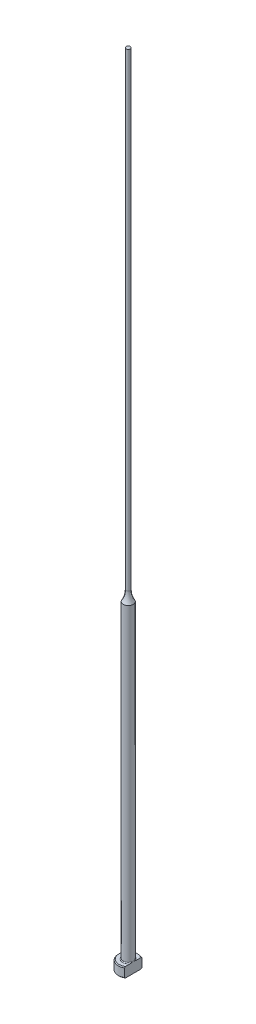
ISO-10303-21;
HEADER;
FILE_DESCRIPTION(('STEP AP214'),'2;1');
FILE_NAME('part.step','',(''),(''),'','','');
FILE_SCHEMA(('AUTOMOTIVE_DESIGN { 1 0 10303 214 1 1 1 1 }'));
ENDSEC;
DATA;
#1=APPLICATION_CONTEXT('core data for automotive mechanical design processes');
#2=APPLICATION_PROTOCOL_DEFINITION('international standard','automotive_design',2000,#1);
#3=PRODUCT_CONTEXT('',#1,'mechanical');
#4=PRODUCT('Part','Part','',(#3));
#5=PRODUCT_RELATED_PRODUCT_CATEGORY('part','',(#4));
#6=PRODUCT_DEFINITION_FORMATION('','',#4);
#7=PRODUCT_DEFINITION_CONTEXT('part definition',#1,'design');
#8=PRODUCT_DEFINITION('design','',#6,#7);
#9=PRODUCT_DEFINITION_SHAPE('','',#8);
#10=(LENGTH_UNIT() NAMED_UNIT(*) SI_UNIT(.MILLI.,.METRE.));
#11=(NAMED_UNIT(*) PLANE_ANGLE_UNIT() SI_UNIT($,.RADIAN.));
#12=(NAMED_UNIT(*) SI_UNIT($,.STERADIAN.) SOLID_ANGLE_UNIT());
#13=UNCERTAINTY_MEASURE_WITH_UNIT(LENGTH_MEASURE(1.E-05),#10,'distance_accuracy_value','');
#14=(GEOMETRIC_REPRESENTATION_CONTEXT(3) GLOBAL_UNCERTAINTY_ASSIGNED_CONTEXT((#13)) GLOBAL_UNIT_ASSIGNED_CONTEXT((#10,
#11,#12)) REPRESENTATION_CONTEXT('',''));
#15=CARTESIAN_POINT('',(0.,0.,0.));
#16=DIRECTION('',(0.,0.,1.));
#17=DIRECTION('',(1.,0.,0.));
#18=AXIS2_PLACEMENT_3D('',#15,#16,#17);
#19=CARTESIAN_POINT('',(-3.17499999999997,3.175,0.));
#20=DIRECTION('',(0.,1.,0.));
#21=DIRECTION('',(0.,0.,1.));
#22=AXIS2_PLACEMENT_3D('',#19,#20,#21);
#23=PLANE('',#22);
#24=CARTESIAN_POINT('',(0.,3.175,0.));
#25=DIRECTION('',(0.,1.,0.));
#26=DIRECTION('',(0.,0.,1.));
#27=AXIS2_PLACEMENT_3D('',#24,#25,#26);
#28=CIRCLE('',#27,2.92099999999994);
#29=CARTESIAN_POINT('',(1.58749999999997,3.175,-2.45195529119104));
#30=VERTEX_POINT('',#29);
#31=CARTESIAN_POINT('',(1.58749999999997,3.175,2.45195529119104));
#32=VERTEX_POINT('',#31);
#33=EDGE_CURVE('E105',#30,#32,#28,.T.);
#34=ORIENTED_EDGE('',*,*,#33,.T.);
#35=DIRECTION('',(0.,0.,1.));
#36=VECTOR('',#35,1.);
#37=CARTESIAN_POINT('',(1.58749999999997,3.17499999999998,2.74963065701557));
#38=LINE('',#37,#36);
#39=CARTESIAN_POINT('',(1.58749999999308,3.175,0.933255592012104));
#40=VERTEX_POINT('',#39);
#41=EDGE_CURVE('E126',#40,#32,#38,.T.);
#42=ORIENTED_EDGE('',*,*,#41,.F.);
#43=CARTESIAN_POINT('',(0.,3.175,0.));
#44=DIRECTION('',(0.,1.,0.));
#45=DIRECTION('',(0.,0.,1.));
#46=AXIS2_PLACEMENT_3D('',#43,#44,#45);
#47=CIRCLE('',#46,1.84149999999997);
#48=CARTESIAN_POINT('',(1.58749999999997,3.17500000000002,-0.933255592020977));
#49=VERTEX_POINT('',#48);
#50=EDGE_CURVE('E11',#40,#49,#47,.F.);
#51=ORIENTED_EDGE('',*,*,#50,.T.);
#52=EDGE_CURVE('E52',#30,#49,#38,.T.);
#53=ORIENTED_EDGE('',*,*,#52,.F.);
#54=EDGE_LOOP('',(#34,#42,#51,#53));
#55=FACE_BOUND('',#54,.T.);
#56=ADVANCED_FACE('F32',(#55),#23,.T.);
#57=CARTESIAN_POINT('',(0.,259.958771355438,0.));
#58=DIRECTION('',(0.,1.,0.));
#59=DIRECTION('',(0.,0.,1.));
#60=AXIS2_PLACEMENT_3D('',#57,#58,#59);
#61=CYLINDRICAL_SURFACE('',#60,3.17499999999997);
#62=CARTESIAN_POINT('',(0.,2.92100000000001,0.));
#63=DIRECTION('',(0.,1.,0.));
#64=DIRECTION('',(0.,0.,1.));
#65=AXIS2_PLACEMENT_3D('',#62,#63,#64);
#66=CIRCLE('',#65,3.17499999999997);
#67=CARTESIAN_POINT('',(1.58749999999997,2.92100000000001,2.74963065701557));
#68=VERTEX_POINT('',#67);
#69=CARTESIAN_POINT('',(1.58749999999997,2.92100000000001,-2.74963065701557));
#70=VERTEX_POINT('',#69);
#71=EDGE_CURVE('E98',#68,#70,#66,.F.);
#72=ORIENTED_EDGE('',*,*,#71,.T.);
#73=DIRECTION('',(0.,-1.,0.));
#74=VECTOR('',#73,1.);
#75=CARTESIAN_POINT('',(1.58749999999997,254.001,-2.74963065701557));
#76=LINE('',#75,#74);
#77=CARTESIAN_POINT('',(1.58749999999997,0.253999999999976,-2.74963065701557));
#78=VERTEX_POINT('',#77);
#79=EDGE_CURVE('E141',#70,#78,#76,.T.);
#80=ORIENTED_EDGE('',*,*,#79,.T.);
#81=CARTESIAN_POINT('',(0.,0.253999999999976,0.));
#82=DIRECTION('',(0.,-1.,0.));
#83=DIRECTION('',(0.,0.,-1.));
#84=AXIS2_PLACEMENT_3D('',#81,#82,#83);
#85=CIRCLE('',#84,3.17499999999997);
#86=CARTESIAN_POINT('',(1.58749999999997,0.253999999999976,2.74963065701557));
#87=VERTEX_POINT('',#86);
#88=EDGE_CURVE('E95',#78,#87,#85,.F.);
#89=ORIENTED_EDGE('',*,*,#88,.T.);
#90=DIRECTION('',(0.,-1.,0.));
#91=VECTOR('',#90,1.);
#92=CARTESIAN_POINT('',(1.58749999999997,254.001,2.74963065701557));
#93=LINE('',#92,#91);
#94=EDGE_CURVE('E88',#68,#87,#93,.T.);
#95=ORIENTED_EDGE('',*,*,#94,.F.);
#96=EDGE_LOOP('',(#72,#80,#89,#95));
#97=FACE_BOUND('',#96,.T.);
#98=ADVANCED_FACE('F191',(#97),#61,.T.);
#99=CARTESIAN_POINT('',(0.,0.,0.));
#100=DIRECTION('',(0.,-1.,0.));
#101=DIRECTION('',(0.,0.,-1.));
#102=AXIS2_PLACEMENT_3D('',#99,#100,#101);
#103=PLANE('',#102);
#104=CARTESIAN_POINT('',(0.,0.,0.));
#105=DIRECTION('',(0.,-1.,0.));
#106=DIRECTION('',(0.,0.,-1.));
#107=AXIS2_PLACEMENT_3D('',#104,#105,#106);
#108=CIRCLE('',#107,2.92100000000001);
#109=CARTESIAN_POINT('',(1.58749999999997,0.,2.45195529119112));
#110=VERTEX_POINT('',#109);
#111=CARTESIAN_POINT('',(1.58749999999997,0.,-2.45195529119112));
#112=VERTEX_POINT('',#111);
#113=EDGE_CURVE('E93',#110,#112,#108,.T.);
#114=ORIENTED_EDGE('',*,*,#113,.T.);
#115=DIRECTION('',(0.,0.,1.));
#116=VECTOR('',#115,1.);
#117=CARTESIAN_POINT('',(1.58749999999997,0.,2.74963065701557));
#118=LINE('',#117,#116);
#119=EDGE_CURVE('E78',#112,#110,#118,.T.);
#120=ORIENTED_EDGE('',*,*,#119,.T.);
#121=EDGE_LOOP('',(#114,#120));
#122=FACE_BOUND('',#121,.T.);
#123=ADVANCED_FACE('F97',(#122),#103,.T.);
#124=CARTESIAN_POINT('',(0.,3.17499999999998,0.));
#125=DIRECTION('',(0.,-1.,0.));
#126=DIRECTION('',(0.,0.,-1.));
#127=AXIS2_PLACEMENT_3D('',#124,#125,#126);
#128=CONICAL_SURFACE('',#127,2.92099999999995,0.785398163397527);
#129=ORIENTED_EDGE('',*,*,#71,.F.);
#130=CARTESIAN_POINT('',(1.58749999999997,-0.16162066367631,-6.0529050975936));
#131=CARTESIAN_POINT('',(1.58749999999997,-0.0288893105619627,-5.91567682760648));
#132=CARTESIAN_POINT('',(1.58749999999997,0.103699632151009,-5.7783103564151));
#133=CARTESIAN_POINT('',(1.58749999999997,0.368508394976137,-5.50321874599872));
#134=CARTESIAN_POINT('',(1.58749999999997,0.500728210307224,-5.36549360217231));
#135=CARTESIAN_POINT('',(1.58749999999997,0.764778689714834,-5.08953516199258));
#136=CARTESIAN_POINT('',(1.58749999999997,0.896609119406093,-4.9513016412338));
#137=CARTESIAN_POINT('',(1.58749999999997,1.15968706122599,-4.67428233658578));
#138=CARTESIAN_POINT('',(1.58749999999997,1.29093457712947,-4.53549655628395));
#139=CARTESIAN_POINT('',(1.58749999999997,1.55007705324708,-4.25997724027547));
#140=CARTESIAN_POINT('',(1.58749999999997,1.67798684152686,-4.12325766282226));
#141=CARTESIAN_POINT('',(1.58749999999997,1.9328486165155,-3.84892898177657));
#142=CARTESIAN_POINT('',(1.58749999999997,2.05980060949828,-3.71131988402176));
#143=CARTESIAN_POINT('',(1.58749999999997,2.31237508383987,-3.43493978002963));
#144=CARTESIAN_POINT('',(1.58749999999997,2.43799784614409,-3.29616903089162));
#145=CARTESIAN_POINT('',(1.58749999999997,2.68741369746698,-3.01699558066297));
#146=CARTESIAN_POINT('',(1.58749999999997,2.81120686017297,-2.8765929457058));
#147=CARTESIAN_POINT('',(1.58749999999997,3.00875865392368,-2.64816703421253));
#148=CARTESIAN_POINT('',(1.58749999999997,3.08336151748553,-2.56087478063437));
#149=CARTESIAN_POINT('',(1.58749999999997,3.2312387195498,-2.38515423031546));
#150=CARTESIAN_POINT('',(1.58749999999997,3.30451292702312,-2.29672582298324));
#151=CARTESIAN_POINT('',(1.58749999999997,3.45004422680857,-2.1174740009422));
#152=CARTESIAN_POINT('',(1.58749999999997,3.5222823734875,-2.02663514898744));
#153=CARTESIAN_POINT('',(1.58749999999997,3.66423097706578,-1.8430252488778));
#154=CARTESIAN_POINT('',(1.58749999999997,3.73394203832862,-1.75025467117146));
#155=CARTESIAN_POINT('',(1.58749999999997,3.87080633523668,-1.5606747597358));
#156=CARTESIAN_POINT('',(1.58749999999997,3.93790459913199,-1.46382547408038));
#157=CARTESIAN_POINT('',(1.58749999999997,4.06669147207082,-1.26632594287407));
#158=CARTESIAN_POINT('',(1.58749999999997,4.1283726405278,-1.16567073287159));
#159=CARTESIAN_POINT('',(1.58749999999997,4.21402252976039,-1.01165766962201));
#160=CARTESIAN_POINT('',(1.58749999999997,4.24127929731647,-0.960142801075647));
#161=CARTESIAN_POINT('',(1.58749999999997,4.2930979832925,-0.855780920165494));
#162=CARTESIAN_POINT('',(1.58749999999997,4.31765941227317,-0.802933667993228));
#163=CARTESIAN_POINT('',(1.58749999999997,4.38614656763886,-0.642461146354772));
#164=CARTESIAN_POINT('',(1.58749999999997,4.42510149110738,-0.532518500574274));
#165=CARTESIAN_POINT('',(1.58749999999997,4.46726244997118,-0.367680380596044));
#166=CARTESIAN_POINT('',(1.58749999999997,4.47844427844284,-0.314802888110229));
#167=CARTESIAN_POINT('',(1.58749999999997,4.49576654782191,-0.208209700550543));
#168=CARTESIAN_POINT('',(1.58749999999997,4.50190743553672,-0.154494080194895));
#169=CARTESIAN_POINT('',(1.58749999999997,4.50871296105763,-0.0468792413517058));
#170=CARTESIAN_POINT('',(1.58749999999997,4.5093945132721,0.00701889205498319));
#171=CARTESIAN_POINT('',(1.58749999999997,4.50527679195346,0.114606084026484));
#172=CARTESIAN_POINT('',(1.58749999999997,4.50047706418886,0.168295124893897));
#173=CARTESIAN_POINT('',(1.58749999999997,4.48579689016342,0.27448544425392));
#174=CARTESIAN_POINT('',(1.58749999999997,4.47596081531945,0.32699298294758));
#175=CARTESIAN_POINT('',(1.58749999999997,4.45181809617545,0.430974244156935));
#176=CARTESIAN_POINT('',(1.58749999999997,4.4375096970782,0.482447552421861));
#177=CARTESIAN_POINT('',(1.58749999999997,4.40502489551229,0.584460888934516));
#178=CARTESIAN_POINT('',(1.58749999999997,4.386827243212,0.634994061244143));
#179=CARTESIAN_POINT('',(1.58749999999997,4.34729308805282,0.734789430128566));
#180=CARTESIAN_POINT('',(1.58749999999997,4.3259572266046,0.784051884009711));
#181=CARTESIAN_POINT('',(1.58749999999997,4.25791922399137,0.930549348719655));
#182=CARTESIAN_POINT('',(1.58749999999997,4.20736047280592,1.0259880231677));
#183=CARTESIAN_POINT('',(1.58749999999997,4.0995545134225,1.21304313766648));
#184=CARTESIAN_POINT('',(1.58749999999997,4.04229912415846,1.30465471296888));
#185=CARTESIAN_POINT('',(1.58749999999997,3.92308746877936,1.48526211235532));
#186=CARTESIAN_POINT('',(1.58749999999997,3.86111349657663,1.57424615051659));
#187=CARTESIAN_POINT('',(1.58749999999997,3.73408621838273,1.74990003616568));
#188=CARTESIAN_POINT('',(1.58749999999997,3.66903444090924,1.83657099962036));
#189=CARTESIAN_POINT('',(1.58749999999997,3.53583371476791,2.00931764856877));
#190=CARTESIAN_POINT('',(1.58749999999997,3.46765527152,2.09537048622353));
#191=CARTESIAN_POINT('',(1.58749999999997,3.32960643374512,2.26611736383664));
#192=CARTESIAN_POINT('',(1.58749999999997,3.25973586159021,2.35081125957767));
#193=CARTESIAN_POINT('',(1.58749999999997,3.04858139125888,2.60290121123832));
#194=CARTESIAN_POINT('',(1.58749999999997,2.90542388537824,2.76872537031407));
#195=CARTESIAN_POINT('',(1.58749999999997,2.64069522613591,3.06970913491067));
#196=CARTESIAN_POINT('',(1.58749999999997,2.51959458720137,3.20528660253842));
#197=CARTESIAN_POINT('',(1.58749999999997,2.27590400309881,3.47510321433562));
#198=CARTESIAN_POINT('',(1.58749999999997,2.15331401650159,3.60934232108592));
#199=CARTESIAN_POINT('',(1.58749999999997,1.90694239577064,3.87695374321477));
#200=CARTESIAN_POINT('',(1.58749999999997,1.78315974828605,4.0103251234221));
#201=CARTESIAN_POINT('',(1.58749999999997,1.53478104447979,4.27630880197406));
#202=CARTESIAN_POINT('',(1.58749999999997,1.41018498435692,4.40892109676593));
#203=CARTESIAN_POINT('',(1.58749999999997,1.0457468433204,4.79499418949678));
#204=CARTESIAN_POINT('',(1.58749999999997,0.80507680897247,5.04767313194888));
#205=CARTESIAN_POINT('',(1.58749999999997,0.443121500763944,5.42550911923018));
#206=CARTESIAN_POINT('',(1.58749999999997,0.322378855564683,5.55118772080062));
#207=CARTESIAN_POINT('',(1.58749999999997,0.0805914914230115,5.80225207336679));
#208=CARTESIAN_POINT('',(1.58749999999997,-0.040453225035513,5.92763782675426));
#209=CARTESIAN_POINT('',(1.58749999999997,-0.161620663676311,6.0529050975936));
#210=B_SPLINE_CURVE_WITH_KNOTS('',3,(#130,#131,#132,#133,#134,#135,#136,#137,#138,#139,#140,
#141,#142,#143,#144,#145,#146,#147,#148,#149,#150,#151,#152,#153,#154,#155,#156,#157,#158,#159,
#160,#161,#162,#163,#164,#165,#166,#167,#168,#169,#170,#171,#172,#173,#174,#175,#176,#177,#178,
#179,#180,#181,#182,#183,#184,#185,#186,#187,#188,#189,#190,#191,#192,#193,#194,#195,#196,#197,
#198,#199,#200,#201,#202,#203,#204,#205,#206,#207,#208,#209),.UNSPECIFIED.,.F.,.F.,(4,2,2,2,2,2,
2,2,2,2,2,2,2,2,2,2,2,2,2,2,2,2,2,2,2,2,2,2,2,2,2,2,2,2,2,2,2,2,2,4),(0.,0.572750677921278,
1.14550874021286,1.71856057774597,2.29160869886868,2.85328006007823,3.4149477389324,
3.97649423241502,4.53801804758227,4.88249307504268,5.22700189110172,5.5751532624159,
5.92322081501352,6.27657800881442,6.63041319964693,6.80518126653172,6.9799810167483,
7.3282426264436,7.49018491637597,7.65211285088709,7.81353889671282,7.97497832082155,
8.13501929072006,8.29512313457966,8.45612518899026,8.61709438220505,8.94062993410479,
9.2645649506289,9.58978187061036,9.91483894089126,10.2441741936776,10.5735441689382,
11.2306812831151,11.7760337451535,12.3214014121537,12.8672825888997,13.4131663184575,
14.4600164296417,14.9828595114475,15.5056983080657),.UNSPECIFIED.);
#211=EDGE_CURVE('E118',#32,#68,#210,.T.);
#212=ORIENTED_EDGE('',*,*,#211,.F.);
#213=ORIENTED_EDGE('',*,*,#33,.F.);
#214=EDGE_CURVE('E117',#70,#30,#210,.T.);
#215=ORIENTED_EDGE('',*,*,#214,.F.);
#216=EDGE_LOOP('',(#129,#212,#213,#215));
#217=FACE_BOUND('',#216,.T.);
#218=ADVANCED_FACE('F162',(#217),#128,.T.);
#219=CARTESIAN_POINT('',(0.,0.253999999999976,0.));
#220=DIRECTION('',(0.,1.,0.));
#221=DIRECTION('',(0.,0.,1.));
#222=AXIS2_PLACEMENT_3D('',#219,#220,#221);
#223=CONICAL_SURFACE('',#222,3.17499999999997,0.785398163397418);
#224=ORIENTED_EDGE('',*,*,#88,.F.);
#225=CARTESIAN_POINT('',(1.58749999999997,3.33662066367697,6.0529050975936));
#226=CARTESIAN_POINT('',(1.58749999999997,3.20388931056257,5.91567682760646));
#227=CARTESIAN_POINT('',(1.58749999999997,3.07130036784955,5.77831035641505));
#228=CARTESIAN_POINT('',(1.58749999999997,2.80649160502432,5.50321874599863));
#229=CARTESIAN_POINT('',(1.58749999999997,2.67427178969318,5.3654936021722));
#230=CARTESIAN_POINT('',(1.58749999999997,2.41022131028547,5.08953516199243));
#231=CARTESIAN_POINT('',(1.58749999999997,2.27839088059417,4.95130164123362));
#232=CARTESIAN_POINT('',(1.58749999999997,2.01531293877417,4.67428233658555));
#233=CARTESIAN_POINT('',(1.58749999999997,1.88406542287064,4.5354965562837));
#234=CARTESIAN_POINT('',(1.58749999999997,1.62492294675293,4.25997724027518));
#235=CARTESIAN_POINT('',(1.58749999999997,1.49701315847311,4.12325766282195));
#236=CARTESIAN_POINT('',(1.58749999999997,1.24215138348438,3.84892898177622));
#237=CARTESIAN_POINT('',(1.58749999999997,1.11519939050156,3.71131988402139));
#238=CARTESIAN_POINT('',(1.58749999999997,0.862624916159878,3.43493978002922));
#239=CARTESIAN_POINT('',(1.58749999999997,0.737002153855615,3.29616903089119));
#240=CARTESIAN_POINT('',(1.58749999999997,0.487586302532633,3.01699558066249));
#241=CARTESIAN_POINT('',(1.58749999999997,0.363793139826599,2.8765929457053));
#242=CARTESIAN_POINT('',(1.58749999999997,0.166241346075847,2.64816703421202));
#243=CARTESIAN_POINT('',(1.58749999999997,0.0916384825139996,2.56087478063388));
#244=CARTESIAN_POINT('',(1.58749999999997,-0.0562387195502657,2.385154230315));
#245=CARTESIAN_POINT('',(1.58749999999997,-0.129512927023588,2.29672582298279));
#246=CARTESIAN_POINT('',(1.58749999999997,-0.27504422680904,2.11747400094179));
#247=CARTESIAN_POINT('',(1.58749999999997,-0.347282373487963,2.02663514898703));
#248=CARTESIAN_POINT('',(1.58749999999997,-0.489230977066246,1.84302524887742));
#249=CARTESIAN_POINT('',(1.58749999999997,-0.558942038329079,1.7502546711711));
#250=CARTESIAN_POINT('',(1.58749999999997,-0.695806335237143,1.56067475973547));
#251=CARTESIAN_POINT('',(1.58749999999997,-0.762904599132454,1.46382547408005));
#252=CARTESIAN_POINT('',(1.58749999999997,-0.891691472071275,1.26632594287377));
#253=CARTESIAN_POINT('',(1.58749999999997,-0.953372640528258,1.16567073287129));
#254=CARTESIAN_POINT('',(1.58749999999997,-1.03902252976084,1.01165766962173));
#255=CARTESIAN_POINT('',(1.58749999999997,-1.06627929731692,0.960142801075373));
#256=CARTESIAN_POINT('',(1.58749999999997,-1.11809798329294,0.85578092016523));
#257=CARTESIAN_POINT('',(1.58749999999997,-1.14265941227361,0.802933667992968));
#258=CARTESIAN_POINT('',(1.58749999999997,-1.21114656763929,0.642461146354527));
#259=CARTESIAN_POINT('',(1.58749999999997,-1.2501014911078,0.532518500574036));
#260=CARTESIAN_POINT('',(1.58749999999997,-1.29226244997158,0.367680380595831));
#261=CARTESIAN_POINT('',(1.58749999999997,-1.30344427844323,0.314802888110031));
#262=CARTESIAN_POINT('',(1.58749999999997,-1.32076654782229,0.208209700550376));
#263=CARTESIAN_POINT('',(1.58749999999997,-1.3269074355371,0.154494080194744));
#264=CARTESIAN_POINT('',(1.58749999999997,-1.333712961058,0.0468792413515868));
#265=CARTESIAN_POINT('',(1.58749999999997,-1.33439451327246,-0.00701889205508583));
#266=CARTESIAN_POINT('',(1.58749999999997,-1.33027679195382,-0.114606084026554));
#267=CARTESIAN_POINT('',(1.58749999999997,-1.32547706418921,-0.168295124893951));
#268=CARTESIAN_POINT('',(1.58749999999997,-1.31079689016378,-0.274485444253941));
#269=CARTESIAN_POINT('',(1.58749999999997,-1.3009608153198,-0.326992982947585));
#270=CARTESIAN_POINT('',(1.58749999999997,-1.27681809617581,-0.430974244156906));
#271=CARTESIAN_POINT('',(1.58749999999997,-1.26250969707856,-0.482447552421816));
#272=CARTESIAN_POINT('',(1.58749999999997,-1.23002489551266,-0.584460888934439));
#273=CARTESIAN_POINT('',(1.58749999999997,-1.21182724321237,-0.634994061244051));
#274=CARTESIAN_POINT('',(1.58749999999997,-1.1722930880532,-0.734789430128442));
#275=CARTESIAN_POINT('',(1.58749999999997,-1.15095722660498,-0.784051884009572));
#276=CARTESIAN_POINT('',(1.58749999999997,-1.08291922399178,-0.93054934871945));
#277=CARTESIAN_POINT('',(1.58749999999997,-1.03236047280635,-1.02598802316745));
#278=CARTESIAN_POINT('',(1.58749999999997,-0.924554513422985,-1.21304313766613));
#279=CARTESIAN_POINT('',(1.58749999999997,-0.86729912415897,-1.30465471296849));
#280=CARTESIAN_POINT('',(1.58749999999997,-0.748087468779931,-1.48526211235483));
#281=CARTESIAN_POINT('',(1.58749999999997,-0.686113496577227,-1.57424615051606));
#282=CARTESIAN_POINT('',(1.58749999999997,-0.55908621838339,-1.74990003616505));
#283=CARTESIAN_POINT('',(1.58749999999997,-0.494034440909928,-1.83657099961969));
#284=CARTESIAN_POINT('',(1.58749999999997,-0.360833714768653,-2.00931764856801));
#285=CARTESIAN_POINT('',(1.58749999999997,-0.292655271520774,-2.09537048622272));
#286=CARTESIAN_POINT('',(1.58749999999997,-0.154606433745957,-2.26611736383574));
#287=CARTESIAN_POINT('',(1.58749999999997,-0.0847358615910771,-2.35081125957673));
#288=CARTESIAN_POINT('',(1.58749999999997,0.126418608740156,-2.60290121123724));
#289=CARTESIAN_POINT('',(1.58749999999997,0.269576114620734,-2.76872537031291));
#290=CARTESIAN_POINT('',(1.58749999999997,0.534304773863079,-3.06970913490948));
#291=CARTESIAN_POINT('',(1.58749999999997,0.655405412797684,-3.20528660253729));
#292=CARTESIAN_POINT('',(1.58749999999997,0.899095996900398,-3.47510321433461));
#293=CARTESIAN_POINT('',(1.58749999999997,1.02168598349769,-3.60934232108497));
#294=CARTESIAN_POINT('',(1.58749999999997,1.26805760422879,-3.87695374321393));
#295=CARTESIAN_POINT('',(1.58749999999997,1.39184025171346,-4.01032512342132));
#296=CARTESIAN_POINT('',(1.58749999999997,1.64021895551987,-4.2763088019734));
#297=CARTESIAN_POINT('',(1.58749999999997,1.76481501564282,-4.40892109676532));
#298=CARTESIAN_POINT('',(1.58749999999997,2.12925315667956,-4.79499418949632));
#299=CARTESIAN_POINT('',(1.58749999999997,2.36992319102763,-5.04767313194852));
#300=CARTESIAN_POINT('',(1.58749999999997,2.73187849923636,-5.42550911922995));
#301=CARTESIAN_POINT('',(1.58749999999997,2.85262114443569,-5.55118772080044));
#302=CARTESIAN_POINT('',(1.58749999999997,3.09440850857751,-5.8022520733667));
#303=CARTESIAN_POINT('',(1.58749999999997,3.2154532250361,-5.92763782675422));
#304=CARTESIAN_POINT('',(1.58749999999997,3.33662066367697,-6.0529050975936));
#305=B_SPLINE_CURVE_WITH_KNOTS('',3,(#225,#226,#227,#228,#229,#230,#231,#232,#233,#234,#235,
#236,#237,#238,#239,#240,#241,#242,#243,#244,#245,#246,#247,#248,#249,#250,#251,#252,#253,#254,
#255,#256,#257,#258,#259,#260,#261,#262,#263,#264,#265,#266,#267,#268,#269,#270,#271,#272,#273,
#274,#275,#276,#277,#278,#279,#280,#281,#282,#283,#284,#285,#286,#287,#288,#289,#290,#291,#292,
#293,#294,#295,#296,#297,#298,#299,#300,#301,#302,#303,#304),.UNSPECIFIED.,.F.,.F.,(4,2,2,2,2,2,
2,2,2,2,2,2,2,2,2,2,2,2,2,2,2,2,2,2,2,2,2,2,2,2,2,2,2,2,2,2,2,2,2,4),(0.,0.57275067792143,
1.14550874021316,1.71856057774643,2.29160869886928,2.85328006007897,3.41494773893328,
3.97649423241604,4.53801804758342,4.88249307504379,5.2270018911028,5.57515326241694,
5.92322081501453,6.27657800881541,6.63041319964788,6.80518126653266,6.97998101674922,
7.32824262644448,7.49018491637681,7.65211285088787,7.81353889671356,7.97497832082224,
8.1350192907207,8.29512313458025,8.45612518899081,8.61709438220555,8.94062993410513,
9.26456495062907,9.58978187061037,9.91483894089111,10.2441741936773,10.5735441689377,
11.2306812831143,11.776033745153,12.3214014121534,12.8672825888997,13.4131663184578,
14.4600164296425,14.9828595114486,15.505698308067),.UNSPECIFIED.);
#306=EDGE_CURVE('E81',#112,#78,#305,.T.);
#307=ORIENTED_EDGE('',*,*,#306,.F.);
#308=ORIENTED_EDGE('',*,*,#113,.F.);
#309=EDGE_CURVE('E84',#87,#110,#305,.T.);
#310=ORIENTED_EDGE('',*,*,#309,.F.);
#311=EDGE_LOOP('',(#224,#307,#308,#310));
#312=FACE_BOUND('',#311,.T.);
#313=ADVANCED_FACE('F92',(#312),#223,.T.);
#314=CARTESIAN_POINT('',(0.,3.42900000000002,0.));
#315=DIRECTION('',(0.,1.,0.));
#316=DIRECTION('',(0.,0.,1.));
#317=AXIS2_PLACEMENT_3D('',#314,#315,#316);
#318=TOROIDAL_SURFACE('',#317,1.84149999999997,0.254);
#319=CARTESIAN_POINT('',(1.58749999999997,3.42900000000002,0.));
#320=CARTESIAN_POINT('',(1.58749999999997,3.42899942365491,-1.9220514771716E-10));
#321=CARTESIAN_POINT('',(1.58749999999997,3.42899884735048,-1.2261161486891E-07));
#322=CARTESIAN_POINT('',(1.58749999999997,3.42899773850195,-5.09676365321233E-07));
#323=CARTESIAN_POINT('',(1.58749999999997,3.42899720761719,-7.78176328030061E-07));
#324=CARTESIAN_POINT('',(1.58749999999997,3.42899614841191,-1.42307272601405E-06));
#325=CARTESIAN_POINT('',(1.58749999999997,3.42899562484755,-1.80713867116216E-06));
#326=CARTESIAN_POINT('',(1.58749999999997,3.42899463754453,-2.63494846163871E-06));
#327=CARTESIAN_POINT('',(1.58749999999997,3.42899417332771,-3.07814756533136E-06));
#328=CARTESIAN_POINT('',(1.58749999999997,3.42899261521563,-4.66897357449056E-06));
#329=CARTESIAN_POINT('',(1.58749999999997,3.42899159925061,-5.89404908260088E-06));
#330=CARTESIAN_POINT('',(1.58749999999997,3.42898979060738,-8.42427511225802E-06));
#331=CARTESIAN_POINT('',(1.58749999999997,3.42898899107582,-9.7248057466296E-06));
#332=CARTESIAN_POINT('',(1.58749999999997,3.42898598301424,-1.48060601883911E-05));
#333=CARTESIAN_POINT('',(1.58749999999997,3.42898393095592,-1.86838281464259E-05));
#334=CARTESIAN_POINT('',(1.58749999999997,3.42898057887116,-2.63261117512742E-05));
#335=CARTESIAN_POINT('',(1.58749999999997,3.42897922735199,-3.00687417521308E-05));
#336=CARTESIAN_POINT('',(1.58749999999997,3.42897347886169,-4.60276298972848E-05));
#337=CARTESIAN_POINT('',(1.58749999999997,3.42896911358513,-5.8247019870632E-05));
#338=CARTESIAN_POINT('',(1.58749999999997,3.42896211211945,-8.11070097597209E-05));
#339=CARTESIAN_POINT('',(1.58749999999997,3.42895931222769,-9.16953114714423E-05));
#340=CARTESIAN_POINT('',(1.58749999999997,3.42893712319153,-0.000168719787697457));
#341=CARTESIAN_POINT('',(1.58749999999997,3.42890881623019,-0.000232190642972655));
#342=CARTESIAN_POINT('',(1.58749999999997,3.42880276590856,-0.000479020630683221));
#343=CARTESIAN_POINT('',(1.58749999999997,3.42873165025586,-0.00066443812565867));
#344=CARTESIAN_POINT('',(1.58749999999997,3.42845137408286,-0.0013844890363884));
#345=CARTESIAN_POINT('',(1.58749999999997,3.42823526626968,-0.00191701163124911));
#346=CARTESIAN_POINT('',(1.58749999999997,3.42735449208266,-0.00409774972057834));
#347=CARTESIAN_POINT('',(1.58749999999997,3.42669768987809,-0.00574830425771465));
#348=CARTESIAN_POINT('',(1.58749999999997,3.4174405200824,-0.0289985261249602));
#349=CARTESIAN_POINT('',(1.58749999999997,3.40878325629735,-0.0505816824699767));
#350=CARTESIAN_POINT('',(1.58749999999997,3.39189297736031,-0.0929947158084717));
#351=CARTESIAN_POINT('',(1.58749999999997,3.38365605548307,-0.11382315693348));
#352=CARTESIAN_POINT('',(1.58749999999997,3.36635393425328,-0.157956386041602));
#353=CARTESIAN_POINT('',(1.58749999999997,3.35730391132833,-0.181267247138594));
#354=CARTESIAN_POINT('',(1.58749999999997,3.33936775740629,-0.228222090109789));
#355=CARTESIAN_POINT('',(1.58749999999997,3.33048420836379,-0.25186705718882));
#356=CARTESIAN_POINT('',(1.58749999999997,3.30894496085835,-0.310512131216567));
#357=CARTESIAN_POINT('',(1.58749999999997,3.29649449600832,-0.345588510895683));
#358=CARTESIAN_POINT('',(1.58749999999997,3.27296975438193,-0.415278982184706));
#359=CARTESIAN_POINT('',(1.58749999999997,3.26186987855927,-0.449884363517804));
#360=CARTESIAN_POINT('',(1.58749999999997,3.2395832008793,-0.524471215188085));
#361=CARTESIAN_POINT('',(1.58749999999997,3.22860862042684,-0.564517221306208));
#362=CARTESIAN_POINT('',(1.58749999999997,3.20902534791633,-0.645529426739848));
#363=CARTESIAN_POINT('',(1.58749999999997,3.20043582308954,-0.686500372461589));
#364=CARTESIAN_POINT('',(1.58749999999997,3.18611712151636,-0.771546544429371));
#365=CARTESIAN_POINT('',(1.58749999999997,3.18059550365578,-0.815658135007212));
#366=CARTESIAN_POINT('',(1.58749999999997,3.17455396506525,-0.904117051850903));
#367=CARTESIAN_POINT('',(1.58749999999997,3.17401361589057,-0.948462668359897));
#368=CARTESIAN_POINT('',(1.58749999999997,3.17898948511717,-1.02531896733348));
#369=CARTESIAN_POINT('',(1.58749999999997,3.1829739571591,-1.05792141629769));
#370=CARTESIAN_POINT('',(1.58749999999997,3.19569167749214,-1.12184393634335));
#371=CARTESIAN_POINT('',(1.58749999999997,3.20436049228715,-1.1531753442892));
#372=CARTESIAN_POINT('',(1.58749999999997,3.22236152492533,-1.19946468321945));
#373=CARTESIAN_POINT('',(1.58749999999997,3.2295150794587,-1.21526783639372));
#374=CARTESIAN_POINT('',(1.58749999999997,3.24587062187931,-1.24583726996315));
#375=CARTESIAN_POINT('',(1.58749999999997,3.25507530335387,-1.26060215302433));
#376=CARTESIAN_POINT('',(1.58749999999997,3.27378481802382,-1.28575815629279));
#377=CARTESIAN_POINT('',(1.58749999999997,3.28289001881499,-1.29644383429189));
#378=CARTESIAN_POINT('',(1.58749999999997,3.30268460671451,-1.31623154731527));
#379=CARTESIAN_POINT('',(1.58749999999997,3.31337067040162,-1.32533681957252));
#380=CARTESIAN_POINT('',(1.58749999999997,3.33349977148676,-1.33941140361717));
#381=CARTESIAN_POINT('',(1.58749999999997,3.34261446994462,-1.34484814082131));
#382=CARTESIAN_POINT('',(1.58749999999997,3.36161455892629,-1.35416329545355));
#383=CARTESIAN_POINT('',(1.58749999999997,3.37149946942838,-1.35804267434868));
#384=CARTESIAN_POINT('',(1.58749999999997,3.39188678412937,-1.36398436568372));
#385=CARTESIAN_POINT('',(1.58749999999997,3.40239309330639,-1.36603350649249));
#386=CARTESIAN_POINT('',(1.58749999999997,3.42360372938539,-1.3680840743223));
#387=CARTESIAN_POINT('',(1.58749999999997,3.43430795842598,-1.36808648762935));
#388=CARTESIAN_POINT('',(1.58749999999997,3.45433283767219,-1.36616208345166));
#389=CARTESIAN_POINT('',(1.58749999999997,3.46367506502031,-1.36444960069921));
#390=CARTESIAN_POINT('',(1.58749999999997,3.48195519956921,-1.35953338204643));
#391=CARTESIAN_POINT('',(1.58749999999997,3.49089304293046,-1.3563294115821));
#392=CARTESIAN_POINT('',(1.58749999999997,3.50850302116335,-1.34848006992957));
#393=CARTESIAN_POINT('',(1.58749999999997,3.5171531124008,-1.34378578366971));
#394=CARTESIAN_POINT('',(1.58749999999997,3.53371257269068,-1.33324445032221));
#395=CARTESIAN_POINT('',(1.58749999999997,3.54162163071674,-1.32739692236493));
#396=CARTESIAN_POINT('',(1.58749999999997,3.56107121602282,-1.31107304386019));
#397=CARTESIAN_POINT('',(1.58749999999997,3.57202221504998,-1.29989286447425));
#398=CARTESIAN_POINT('',(1.58749999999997,3.59202509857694,-1.27593566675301));
#399=CARTESIAN_POINT('',(1.58749999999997,3.60107086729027,-1.26315370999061));
#400=CARTESIAN_POINT('',(1.58749999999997,3.62186023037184,-1.22930733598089));
#401=CARTESIAN_POINT('',(1.58749999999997,3.63240584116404,-1.20751096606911));
#402=CARTESIAN_POINT('',(1.58749999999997,3.65004643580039,-1.16266144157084));
#403=CARTESIAN_POINT('',(1.58749999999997,3.65714435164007,-1.13960937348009));
#404=CARTESIAN_POINT('',(1.58749999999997,3.67265428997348,-1.07603916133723));
#405=CARTESIAN_POINT('',(1.58749999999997,3.67834921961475,-1.03486686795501));
#406=CARTESIAN_POINT('',(1.58749999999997,3.68382880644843,-0.951558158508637));
#407=CARTESIAN_POINT('',(1.58749999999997,3.68350976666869,-0.909417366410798));
#408=CARTESIAN_POINT('',(1.58749999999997,3.67745397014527,-0.811383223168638));
#409=CARTESIAN_POINT('',(1.58749999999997,3.66993873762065,-0.755610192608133));
#410=CARTESIAN_POINT('',(1.58749999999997,3.64933373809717,-0.644937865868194));
#411=CARTESIAN_POINT('',(1.58749999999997,3.63621897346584,-0.59004364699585));
#412=CARTESIAN_POINT('',(1.58749999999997,3.60740922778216,-0.485757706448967));
#413=CARTESIAN_POINT('',(1.58749999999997,3.59201096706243,-0.436281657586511));
#414=CARTESIAN_POINT('',(1.58749999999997,3.55922497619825,-0.338551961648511));
#415=CARTESIAN_POINT('',(1.58749999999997,3.5418584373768,-0.290291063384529));
#416=CARTESIAN_POINT('',(1.58749999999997,3.51760237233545,-0.225557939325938));
#417=CARTESIAN_POINT('',(1.58749999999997,3.51126413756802,-0.208874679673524));
#418=CARTESIAN_POINT('',(1.58749999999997,3.49830042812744,-0.17512392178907));
#419=CARTESIAN_POINT('',(1.58749999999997,3.49167176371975,-0.158057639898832));
#420=CARTESIAN_POINT('',(1.58749999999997,3.47585523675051,-0.117638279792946));
#421=CARTESIAN_POINT('',(1.58749999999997,3.46662970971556,-0.0943002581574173));
#422=CARTESIAN_POINT('',(1.58749999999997,3.44889695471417,-0.0497824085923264));
#423=CARTESIAN_POINT('',(1.58749999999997,3.44040039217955,-0.028598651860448));
#424=CARTESIAN_POINT('',(1.58749999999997,3.43130364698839,-0.00575168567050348));
#425=CARTESIAN_POINT('',(1.58749999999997,3.43064818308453,-0.00410451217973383));
#426=CARTESIAN_POINT('',(1.58749999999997,3.42976776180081,-0.00192459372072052));
#427=CARTESIAN_POINT('',(1.58749999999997,3.42955062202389,-0.00138952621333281));
#428=CARTESIAN_POINT('',(1.58749999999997,3.42926908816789,-0.000666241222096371));
#429=CARTESIAN_POINT('',(1.58749999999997,3.42919771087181,-0.000480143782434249));
#430=CARTESIAN_POINT('',(1.58749999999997,3.42909131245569,-0.000232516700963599));
#431=CARTESIAN_POINT('',(1.58749999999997,3.42906294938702,-0.000168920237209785));
#432=CARTESIAN_POINT('',(1.58749999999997,3.42904072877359,-9.17527162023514E-05));
#433=CARTESIAN_POINT('',(1.58749999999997,3.42903792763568,-8.11550293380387E-05));
#434=CARTESIAN_POINT('',(1.58749999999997,3.42903091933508,-5.82743948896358E-05));
#435=CARTESIAN_POINT('',(1.58749999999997,3.42902654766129,-4.60440001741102E-05));
#436=CARTESIAN_POINT('',(1.58749999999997,3.42902079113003,-3.00727682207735E-05));
#437=CARTESIAN_POINT('',(1.58749999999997,3.42901943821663,-2.63286807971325E-05));
#438=CARTESIAN_POINT('',(1.58749999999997,3.42901608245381,-1.86836529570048E-05));
#439=CARTESIAN_POINT('',(1.58749999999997,3.4290140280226,-1.48046517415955E-05));
#440=CARTESIAN_POINT('',(1.58749999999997,3.42901101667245,-9.72223943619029E-06));
#441=CARTESIAN_POINT('',(1.58749999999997,3.42901021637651,-8.42159649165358E-06));
#442=CARTESIAN_POINT('',(1.58749999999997,3.42900840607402,-5.89129729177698E-06));
#443=CARTESIAN_POINT('',(1.58749999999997,3.42900738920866,-4.66626867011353E-06));
#444=CARTESIAN_POINT('',(1.58749999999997,3.42900582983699,-3.07568803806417E-06));
#445=CARTESIAN_POINT('',(1.58749999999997,3.42900536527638,-2.63259565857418E-06));
#446=CARTESIAN_POINT('',(1.58749999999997,3.4290043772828,-1.80506085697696E-06));
#447=CARTESIAN_POINT('',(1.58749999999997,3.42900385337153,-1.42116387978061E-06));
#448=CARTESIAN_POINT('',(1.58749999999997,3.42900279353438,-7.76675643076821E-07));
#449=CARTESIAN_POINT('',(1.58749999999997,3.42900226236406,-5.08406487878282E-07));
#450=CARTESIAN_POINT('',(1.58749999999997,3.42900115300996,-1.21901887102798E-07));
#451=CARTESIAN_POINT('',(1.58749999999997,3.42900057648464,1.92251677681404E-10));
#452=CARTESIAN_POINT('',(1.58749999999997,3.42900000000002,0.));
#453=B_SPLINE_CURVE_WITH_KNOTS('',3,(#319,#320,#321,#322,#323,#324,#325,#326,#327,#328,#329,
#330,#331,#332,#333,#334,#335,#336,#337,#338,#339,#340,#341,#342,#343,#344,#345,#346,#347,#348,
#349,#350,#351,#352,#353,#354,#355,#356,#357,#358,#359,#360,#361,#362,#363,#364,#365,#366,#367,
#368,#369,#370,#371,#372,#373,#374,#375,#376,#377,#378,#379,#380,#381,#382,#383,#384,#385,#386,
#387,#388,#389,#390,#391,#392,#393,#394,#395,#396,#397,#398,#399,#400,#401,#402,#403,#404,#405,
#406,#407,#408,#409,#410,#411,#412,#413,#414,#415,#416,#417,#418,#419,#420,#421,#422,#423,#424,
#425,#426,#427,#428,#429,#430,#431,#432,#433,#434,#435,#436,#437,#438,#439,#440,#441,#442,#443,
#444,#445,#446,#447,#448,#449,#450,#451,#452),.UNSPECIFIED.,.T.,.F.,(4,2,2,2,2,2,2,2,2,2,2,2,2,
2,2,2,2,2,2,2,2,2,2,2,2,2,2,2,2,2,2,2,2,2,2,2,2,2,2,2,2,2,2,2,2,2,2,2,2,2,2,2,2,2,2,2,2,2,2,2,2,
2,2,2,2,2,4),(0.,1.72815458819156E-06,3.50429255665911E-06,5.44431004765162E-06,
7.3675525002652E-06,1.2119089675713E-05,1.66953775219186E-05,2.98160400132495E-05,
4.17409564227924E-05,8.0660475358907E-05,0.000113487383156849,0.000321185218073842,
0.000917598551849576,0.00264089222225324,0.00797105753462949,0.0777276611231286,
0.144923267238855,0.219939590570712,0.295714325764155,0.407362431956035,0.516367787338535,
0.640878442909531,0.766362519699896,0.899536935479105,1.03216495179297,1.13045740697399,
1.22743103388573,1.27935899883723,1.33135556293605,1.37333248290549,1.41522237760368,
1.44693946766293,1.47863694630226,1.51056074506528,1.54246916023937,1.57083210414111,
1.59919951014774,1.62861579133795,1.65804436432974,1.70472658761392,1.75155645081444,
1.82378709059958,1.89595619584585,2.01995471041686,2.1460932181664,2.31447224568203,
2.48361094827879,2.6389891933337,2.79283011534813,2.84637031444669,2.9012946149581,
2.97658236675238,3.04504771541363,3.05036697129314,3.05209849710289,3.05269709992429,
3.05290520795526,3.05293806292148,3.05297701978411,3.05298895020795,3.05300207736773,
3.05300665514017,3.0530114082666,3.05301333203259,3.05301527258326,3.05301704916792,
3.05301877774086),.UNSPECIFIED.);
#454=CARTESIAN_POINT('',(1.58749999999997,3.42900000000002,0.));
#455=VERTEX_POINT('',#454);
#456=EDGE_CURVE('E47',#455,#49,#453,.T.);
#457=ORIENTED_EDGE('',*,*,#456,.T.);
#458=ORIENTED_EDGE('',*,*,#50,.F.);
#459=CARTESIAN_POINT('',(1.58749999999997,3.42900000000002,0.));
#460=CARTESIAN_POINT('',(1.58749999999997,3.42900057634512,1.9220512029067E-10));
#461=CARTESIAN_POINT('',(1.58749999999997,3.42900115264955,1.22611614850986E-07));
#462=CARTESIAN_POINT('',(1.58749999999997,3.42900226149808,5.09676365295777E-07));
#463=CARTESIAN_POINT('',(1.58749999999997,3.42900279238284,7.78176328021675E-07));
#464=CARTESIAN_POINT('',(1.58749999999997,3.42900385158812,1.42307272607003E-06));
#465=CARTESIAN_POINT('',(1.58749999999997,3.42900437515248,1.80713867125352E-06));
#466=CARTESIAN_POINT('',(1.58749999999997,3.4290053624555,2.63494846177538E-06));
#467=CARTESIAN_POINT('',(1.58749999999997,3.42900582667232,3.0781475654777E-06));
#468=CARTESIAN_POINT('',(1.58749999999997,3.4290073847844,4.66897357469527E-06));
#469=CARTESIAN_POINT('',(1.58749999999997,3.42900840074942,5.89404908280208E-06));
#470=CARTESIAN_POINT('',(1.58749999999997,3.42901020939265,8.42427511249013E-06));
#471=CARTESIAN_POINT('',(1.58749999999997,3.42901100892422,9.72480574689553E-06));
#472=CARTESIAN_POINT('',(1.58749999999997,3.42901401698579,1.48060601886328E-05));
#473=CARTESIAN_POINT('',(1.58749999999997,3.42901606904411,1.86838281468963E-05));
#474=CARTESIAN_POINT('',(1.58749999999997,3.42901942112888,2.63261117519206E-05));
#475=CARTESIAN_POINT('',(1.58749999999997,3.42902077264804,3.00687417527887E-05));
#476=CARTESIAN_POINT('',(1.58749999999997,3.42902652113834,4.60276298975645E-05));
#477=CARTESIAN_POINT('',(1.58749999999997,3.4290308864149,5.82470198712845E-05));
#478=CARTESIAN_POINT('',(1.58749999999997,3.42903788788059,8.11070097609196E-05));
#479=CARTESIAN_POINT('',(1.58749999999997,3.42904068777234,9.16953114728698E-05));
#480=CARTESIAN_POINT('',(1.58749999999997,3.4290628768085,0.000168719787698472));
#481=CARTESIAN_POINT('',(1.58749999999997,3.42909118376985,0.000232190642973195));
#482=CARTESIAN_POINT('',(1.58749999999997,3.42919723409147,0.000479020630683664));
#483=CARTESIAN_POINT('',(1.58749999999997,3.42926834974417,0.000664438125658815));
#484=CARTESIAN_POINT('',(1.58749999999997,3.42954862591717,0.00138448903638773));
#485=CARTESIAN_POINT('',(1.58749999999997,3.42976473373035,0.00191701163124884));
#486=CARTESIAN_POINT('',(1.58749999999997,3.43064550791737,0.00409774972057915));
#487=CARTESIAN_POINT('',(1.58749999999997,3.43130231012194,0.00574830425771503));
#488=CARTESIAN_POINT('',(1.58749999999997,3.44055947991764,0.0289985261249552));
#489=CARTESIAN_POINT('',(1.58749999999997,3.44921674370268,0.0505816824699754));
#490=CARTESIAN_POINT('',(1.58749999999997,3.46610702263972,0.0929947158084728));
#491=CARTESIAN_POINT('',(1.58749999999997,3.47434394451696,0.11382315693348));
#492=CARTESIAN_POINT('',(1.58749999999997,3.49164606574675,0.157956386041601));
#493=CARTESIAN_POINT('',(1.58749999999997,3.5006960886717,0.181267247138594));
#494=CARTESIAN_POINT('',(1.58749999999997,3.51863224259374,0.228222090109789));
#495=CARTESIAN_POINT('',(1.58749999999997,3.52751579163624,0.25186705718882));
#496=CARTESIAN_POINT('',(1.58749999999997,3.54905503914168,0.310512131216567));
#497=CARTESIAN_POINT('',(1.58749999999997,3.56150550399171,0.345588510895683));
#498=CARTESIAN_POINT('',(1.58749999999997,3.5850302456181,0.415278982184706));
#499=CARTESIAN_POINT('',(1.58749999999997,3.59613012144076,0.449884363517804));
#500=CARTESIAN_POINT('',(1.58749999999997,3.61841679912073,0.524471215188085));
#501=CARTESIAN_POINT('',(1.58749999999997,3.62939137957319,0.564517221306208));
#502=CARTESIAN_POINT('',(1.58749999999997,3.6489746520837,0.645529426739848));
#503=CARTESIAN_POINT('',(1.58749999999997,3.65756417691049,0.686500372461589));
#504=CARTESIAN_POINT('',(1.58749999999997,3.67188287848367,0.771546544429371));
#505=CARTESIAN_POINT('',(1.58749999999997,3.67740449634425,0.815658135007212));
#506=CARTESIAN_POINT('',(1.58749999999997,3.68344603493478,0.904117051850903));
#507=CARTESIAN_POINT('',(1.58749999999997,3.68398638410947,0.948462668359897));
#508=CARTESIAN_POINT('',(1.58749999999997,3.67901051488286,1.02531896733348));
#509=CARTESIAN_POINT('',(1.58749999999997,3.67502604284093,1.05792141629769));
#510=CARTESIAN_POINT('',(1.58749999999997,3.66230832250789,1.12184393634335));
#511=CARTESIAN_POINT('',(1.58749999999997,3.65363950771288,1.1531753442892));
#512=CARTESIAN_POINT('',(1.58749999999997,3.6356384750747,1.19946468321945));
#513=CARTESIAN_POINT('',(1.58749999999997,3.62848492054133,1.21526783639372));
#514=CARTESIAN_POINT('',(1.58749999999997,3.61212937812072,1.24583726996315));
#515=CARTESIAN_POINT('',(1.58749999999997,3.60292469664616,1.26060215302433));
#516=CARTESIAN_POINT('',(1.58749999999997,3.58421518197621,1.28575815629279));
#517=CARTESIAN_POINT('',(1.58749999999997,3.57510998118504,1.29644383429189));
#518=CARTESIAN_POINT('',(1.58749999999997,3.55531539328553,1.31623154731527));
#519=CARTESIAN_POINT('',(1.58749999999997,3.54462932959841,1.32533681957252));
#520=CARTESIAN_POINT('',(1.58749999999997,3.52450022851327,1.33941140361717));
#521=CARTESIAN_POINT('',(1.58749999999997,3.51538553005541,1.34484814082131));
#522=CARTESIAN_POINT('',(1.58749999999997,3.49638544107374,1.35416329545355));
#523=CARTESIAN_POINT('',(1.58749999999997,3.48650053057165,1.35804267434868));
#524=CARTESIAN_POINT('',(1.58749999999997,3.46611321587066,1.36398436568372));
#525=CARTESIAN_POINT('',(1.58749999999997,3.45560690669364,1.36603350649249));
#526=CARTESIAN_POINT('',(1.58749999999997,3.43439627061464,1.3680840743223));
#527=CARTESIAN_POINT('',(1.58749999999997,3.42369204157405,1.36808648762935));
#528=CARTESIAN_POINT('',(1.58749999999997,3.40366716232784,1.36616208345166));
#529=CARTESIAN_POINT('',(1.58749999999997,3.39432493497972,1.36444960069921));
#530=CARTESIAN_POINT('',(1.58749999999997,3.37604480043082,1.35953338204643));
#531=CARTESIAN_POINT('',(1.58749999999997,3.36710695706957,1.3563294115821));
#532=CARTESIAN_POINT('',(1.58749999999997,3.34949697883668,1.34848006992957));
#533=CARTESIAN_POINT('',(1.58749999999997,3.34084688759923,1.34378578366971));
#534=CARTESIAN_POINT('',(1.58749999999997,3.32428742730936,1.33324445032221));
#535=CARTESIAN_POINT('',(1.58749999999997,3.31637836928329,1.32739692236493));
#536=CARTESIAN_POINT('',(1.58749999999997,3.29692878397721,1.31107304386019));
#537=CARTESIAN_POINT('',(1.58749999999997,3.28597778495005,1.29989286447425));
#538=CARTESIAN_POINT('',(1.58749999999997,3.26597490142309,1.27593566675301));
#539=CARTESIAN_POINT('',(1.58749999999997,3.25692913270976,1.26315370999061));
#540=CARTESIAN_POINT('',(1.58749999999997,3.23613976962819,1.22930733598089));
#541=CARTESIAN_POINT('',(1.58749999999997,3.22559415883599,1.20751096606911));
#542=CARTESIAN_POINT('',(1.58749999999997,3.20795356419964,1.16266144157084));
#543=CARTESIAN_POINT('',(1.58749999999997,3.20085564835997,1.13960937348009));
#544=CARTESIAN_POINT('',(1.58749999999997,3.18534571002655,1.07603916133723));
#545=CARTESIAN_POINT('',(1.58749999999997,3.17965078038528,1.03486686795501));
#546=CARTESIAN_POINT('',(1.58749999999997,3.1741711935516,0.951558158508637));
#547=CARTESIAN_POINT('',(1.58749999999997,3.17449023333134,0.909417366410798));
#548=CARTESIAN_POINT('',(1.58749999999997,3.18054602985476,0.811383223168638));
#549=CARTESIAN_POINT('',(1.58749999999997,3.18806126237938,0.755610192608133));
#550=CARTESIAN_POINT('',(1.58749999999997,3.20866626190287,0.644937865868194));
#551=CARTESIAN_POINT('',(1.58749999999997,3.2217810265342,0.59004364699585));
#552=CARTESIAN_POINT('',(1.58749999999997,3.25059077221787,0.485757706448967));
#553=CARTESIAN_POINT('',(1.58749999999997,3.2659890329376,0.43628165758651));
#554=CARTESIAN_POINT('',(1.58749999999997,3.29877502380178,0.338551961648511));
#555=CARTESIAN_POINT('',(1.58749999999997,3.31614156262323,0.290291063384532));
#556=CARTESIAN_POINT('',(1.58749999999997,3.34039762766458,0.225557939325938));
#557=CARTESIAN_POINT('',(1.58749999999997,3.346735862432,0.208874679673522));
#558=CARTESIAN_POINT('',(1.58749999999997,3.35969957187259,0.175123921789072));
#559=CARTESIAN_POINT('',(1.58749999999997,3.3663282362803,0.15805763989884));
#560=CARTESIAN_POINT('',(1.58749999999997,3.3821447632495,0.117638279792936));
#561=CARTESIAN_POINT('',(1.58749999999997,3.39137029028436,0.0943002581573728));
#562=CARTESIAN_POINT('',(1.58749999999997,3.40910304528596,0.0497824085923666));
#563=CARTESIAN_POINT('',(1.58749999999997,3.41759960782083,0.0285986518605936));
#564=CARTESIAN_POINT('',(1.58749999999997,3.42669635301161,0.00575168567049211));
#565=CARTESIAN_POINT('',(1.58749999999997,3.42735181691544,0.00410451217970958));
#566=CARTESIAN_POINT('',(1.58749999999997,3.42823223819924,0.00192459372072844));
#567=CARTESIAN_POINT('',(1.58749999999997,3.42844937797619,0.00138952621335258));
#568=CARTESIAN_POINT('',(1.58749999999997,3.42873091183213,0.000666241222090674));
#569=CARTESIAN_POINT('',(1.58749999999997,3.42880228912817,0.000480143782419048));
#570=CARTESIAN_POINT('',(1.58749999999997,3.42890868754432,0.000232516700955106));
#571=CARTESIAN_POINT('',(1.58749999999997,3.42893705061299,0.000168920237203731));
#572=CARTESIAN_POINT('',(1.58749999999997,3.42895927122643,9.17527161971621E-05));
#573=CARTESIAN_POINT('',(1.58749999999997,3.42896207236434,8.1155029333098E-05));
#574=CARTESIAN_POINT('',(1.58749999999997,3.42896908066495,5.82743948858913E-05));
#575=CARTESIAN_POINT('',(1.58749999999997,3.42897345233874,4.60440001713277E-05));
#576=CARTESIAN_POINT('',(1.58749999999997,3.42897920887,3.00727682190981E-05));
#577=CARTESIAN_POINT('',(1.58749999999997,3.42898056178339,2.63286807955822E-05));
#578=CARTESIAN_POINT('',(1.58749999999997,3.42898391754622,1.86836529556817E-05));
#579=CARTESIAN_POINT('',(1.58749999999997,3.42898597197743,1.48046517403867E-05));
#580=CARTESIAN_POINT('',(1.58749999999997,3.42898898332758,9.72223943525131E-06));
#581=CARTESIAN_POINT('',(1.58749999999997,3.42898978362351,8.42159649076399E-06));
#582=CARTESIAN_POINT('',(1.58749999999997,3.42899159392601,5.89129729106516E-06));
#583=CARTESIAN_POINT('',(1.58749999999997,3.42899261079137,4.66626866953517E-06));
#584=CARTESIAN_POINT('',(1.58749999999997,3.42899417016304,3.0756880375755E-06));
#585=CARTESIAN_POINT('',(1.58749999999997,3.42899463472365,2.63259565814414E-06));
#586=CARTESIAN_POINT('',(1.58749999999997,3.42899562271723,1.80506085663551E-06));
#587=CARTESIAN_POINT('',(1.58749999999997,3.42899614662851,1.42116387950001E-06));
#588=CARTESIAN_POINT('',(1.58749999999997,3.42899720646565,7.7667564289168E-07));
#589=CARTESIAN_POINT('',(1.58749999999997,3.42899773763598,5.0840648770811E-07));
#590=CARTESIAN_POINT('',(1.58749999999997,3.42899884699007,1.21901887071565E-07));
#591=CARTESIAN_POINT('',(1.58749999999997,3.42899942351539,-1.92251650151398E-10));
#592=CARTESIAN_POINT('',(1.58749999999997,3.42900000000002,0.));
#593=B_SPLINE_CURVE_WITH_KNOTS('',3,(#459,#460,#461,#462,#463,#464,#465,#466,#467,#468,#469,
#470,#471,#472,#473,#474,#475,#476,#477,#478,#479,#480,#481,#482,#483,#484,#485,#486,#487,#488,
#489,#490,#491,#492,#493,#494,#495,#496,#497,#498,#499,#500,#501,#502,#503,#504,#505,#506,#507,
#508,#509,#510,#511,#512,#513,#514,#515,#516,#517,#518,#519,#520,#521,#522,#523,#524,#525,#526,
#527,#528,#529,#530,#531,#532,#533,#534,#535,#536,#537,#538,#539,#540,#541,#542,#543,#544,#545,
#546,#547,#548,#549,#550,#551,#552,#553,#554,#555,#556,#557,#558,#559,#560,#561,#562,#563,#564,
#565,#566,#567,#568,#569,#570,#571,#572,#573,#574,#575,#576,#577,#578,#579,#580,#581,#582,#583,
#584,#585,#586,#587,#588,#589,#590,#591,#592),.UNSPECIFIED.,.T.,.F.,(4,2,2,2,2,2,2,2,2,2,2,2,2,
2,2,2,2,2,2,2,2,2,2,2,2,2,2,2,2,2,2,2,2,2,2,2,2,2,2,2,2,2,2,2,2,2,2,2,2,2,2,2,2,2,2,2,2,2,2,2,2,
2,2,2,2,2,4),(0.,1.72815458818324E-06,3.50429255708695E-06,5.44431004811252E-06,
7.36755250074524E-06,1.21190896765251E-05,1.66953775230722E-05,2.98160400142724E-05,
4.17409564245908E-05,8.06604753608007E-05,0.000113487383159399,0.000321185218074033,
0.000917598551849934,0.00264089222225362,0.00797105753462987,0.077727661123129,
0.144923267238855,0.219939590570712,0.295714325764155,0.407362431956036,0.516367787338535,
0.640878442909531,0.766362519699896,0.899536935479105,1.03216495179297,1.13045740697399,
1.22743103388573,1.27935899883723,1.33135556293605,1.37333248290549,1.41522237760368,
1.44693946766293,1.47863694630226,1.51056074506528,1.54246916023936,1.57083210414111,
1.59919951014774,1.62861579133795,1.65804436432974,1.70472658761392,1.75155645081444,
1.82378709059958,1.89595619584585,2.01995471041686,2.1460932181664,2.31447224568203,
2.48361094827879,2.6389891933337,2.79283011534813,2.84637031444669,2.9012946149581,
2.97658236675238,3.04504771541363,3.05036697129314,3.05209849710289,3.05269709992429,
3.05290520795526,3.05293806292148,3.05297701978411,3.05298895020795,3.05300207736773,
3.05300665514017,3.0530114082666,3.05301333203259,3.05301527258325,3.05301704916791,
3.05301877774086),.UNSPECIFIED.);
#594=EDGE_CURVE('E147',#40,#455,#593,.T.);
#595=ORIENTED_EDGE('',*,*,#594,.T.);
#596=CARTESIAN_POINT('',(0.,3.42900000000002,0.));
#597=DIRECTION('',(0.,1.,0.));
#598=DIRECTION('',(0.,0.,1.));
#599=AXIS2_PLACEMENT_3D('',#596,#597,#598);
#600=CIRCLE('',#599,1.58749999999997);
#601=EDGE_CURVE('E40',#455,#455,#600,.T.);
#602=ORIENTED_EDGE('',*,*,#601,.F.);
#603=EDGE_LOOP('',(#457,#458,#595,#602));
#604=FACE_BOUND('',#603,.T.);
#605=ADVANCED_FACE('F34',(#604),#318,.F.);
#606=CARTESIAN_POINT('',(-0.657859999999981,254.,0.));
#607=DIRECTION('',(0.,1.,0.));
#608=DIRECTION('',(0.,0.,1.));
#609=AXIS2_PLACEMENT_3D('',#606,#607,#608);
#610=PLANE('',#609);
#611=CARTESIAN_POINT('',(0.,254.,0.));
#612=DIRECTION('',(0.,1.,0.));
#613=DIRECTION('',(0.,0.,1.));
#614=AXIS2_PLACEMENT_3D('',#611,#612,#613);
#615=CIRCLE('',#614,0.657859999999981);
#616=CARTESIAN_POINT('',(0.,254.,0.657859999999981));
#617=VERTEX_POINT('',#616);
#618=EDGE_CURVE('E108',#617,#617,#615,.T.);
#619=ORIENTED_EDGE('',*,*,#618,.T.);
#620=EDGE_LOOP('',(#619));
#621=FACE_BOUND('',#620,.T.);
#622=ADVANCED_FACE('F180',(#621),#610,.T.);
#623=CARTESIAN_POINT('',(0.,259.958771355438,0.));
#624=DIRECTION('',(0.,1.,0.));
#625=DIRECTION('',(0.,0.,1.));
#626=AXIS2_PLACEMENT_3D('',#623,#624,#625);
#627=CYLINDRICAL_SURFACE('',#626,0.657859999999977);
#628=CARTESIAN_POINT('',(0.,104.907899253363,0.));
#629=DIRECTION('',(0.,1.,0.));
#630=DIRECTION('',(0.,0.,1.));
#631=AXIS2_PLACEMENT_3D('',#628,#629,#630);
#632=CIRCLE('',#631,0.657859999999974);
#633=CARTESIAN_POINT('',(0.,104.907899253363,0.657859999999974));
#634=VERTEX_POINT('',#633);
#635=EDGE_CURVE('E111',#634,#634,#632,.T.);
#636=ORIENTED_EDGE('',*,*,#635,.T.);
#637=EDGE_LOOP('',(#636));
#638=FACE_BOUND('',#637,.T.);
#639=ORIENTED_EDGE('',*,*,#618,.F.);
#640=EDGE_LOOP('',(#639));
#641=FACE_BOUND('',#640,.T.);
#642=ADVANCED_FACE('F174',(#638,#641),#627,.T.);
#643=CARTESIAN_POINT('',(0.,104.907899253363,0.));
#644=DIRECTION('',(0.,1.,0.));
#645=DIRECTION('',(0.,0.,1.));
#646=AXIS2_PLACEMENT_3D('',#643,#644,#645);
#647=TOROIDAL_SURFACE('',#646,7.00785999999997,6.35);
#648=CARTESIAN_POINT('',(0.,101.6,0.));
#649=DIRECTION('',(0.,1.,0.));
#650=DIRECTION('',(0.,0.,1.));
#651=AXIS2_PLACEMENT_3D('',#648,#649,#650);
#652=CIRCLE('',#651,1.58749999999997);
#653=CARTESIAN_POINT('',(0.,101.6,1.58749999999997));
#654=VERTEX_POINT('',#653);
#655=EDGE_CURVE('E114',#654,#654,#652,.T.);
#656=ORIENTED_EDGE('',*,*,#655,.T.);
#657=EDGE_LOOP('',(#656));
#658=FACE_BOUND('',#657,.T.);
#659=ORIENTED_EDGE('',*,*,#635,.F.);
#660=EDGE_LOOP('',(#659));
#661=FACE_BOUND('',#660,.T.);
#662=ADVANCED_FACE('F168',(#658,#661),#647,.F.);
#663=CARTESIAN_POINT('',(0.,259.958771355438,0.));
#664=DIRECTION('',(0.,1.,0.));
#665=DIRECTION('',(0.,0.,1.));
#666=AXIS2_PLACEMENT_3D('',#663,#664,#665);
#667=CYLINDRICAL_SURFACE('',#666,1.58749999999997);
#668=ORIENTED_EDGE('',*,*,#601,.T.);
#669=EDGE_LOOP('',(#668));
#670=FACE_BOUND('',#669,.T.);
#671=ORIENTED_EDGE('',*,*,#655,.F.);
#672=EDGE_LOOP('',(#671));
#673=FACE_BOUND('',#672,.T.);
#674=ADVANCED_FACE('F165',(#670,#673),#667,.T.);
#675=CARTESIAN_POINT('',(1.58749999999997,254.001,2.74963065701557));
#676=DIRECTION('',(1.,0.,0.));
#677=DIRECTION('',(0.,0.,-1.));
#678=AXIS2_PLACEMENT_3D('',#675,#676,#677);
#679=PLANE('',#678);
#680=ORIENTED_EDGE('',*,*,#309,.T.);
#681=ORIENTED_EDGE('',*,*,#119,.F.);
#682=ORIENTED_EDGE('',*,*,#306,.T.);
#683=ORIENTED_EDGE('',*,*,#79,.F.);
#684=ORIENTED_EDGE('',*,*,#214,.T.);
#685=ORIENTED_EDGE('',*,*,#52,.T.);
#686=ORIENTED_EDGE('',*,*,#456,.F.);
#687=ORIENTED_EDGE('',*,*,#594,.F.);
#688=ORIENTED_EDGE('',*,*,#41,.T.);
#689=ORIENTED_EDGE('',*,*,#211,.T.);
#690=ORIENTED_EDGE('',*,*,#94,.T.);
#691=EDGE_LOOP('',(#680,#681,#682,#683,#684,#685,#686,#687,#688,#689,#690));
#692=FACE_BOUND('',#691,.T.);
#693=ADVANCED_FACE('F80',(#692),#679,.T.);
#694=CLOSED_SHELL('',(#56,#98,#123,#218,#313,#605,#622,#642,#662,#674,#693));
#695=MANIFOLD_SOLID_BREP('B2',#694);
#696=ADVANCED_BREP_SHAPE_REPRESENTATION('',(#18,#695),#14);
#697=SHAPE_DEFINITION_REPRESENTATION(#9,#696);
ENDSEC;
END-ISO-10303-21;
